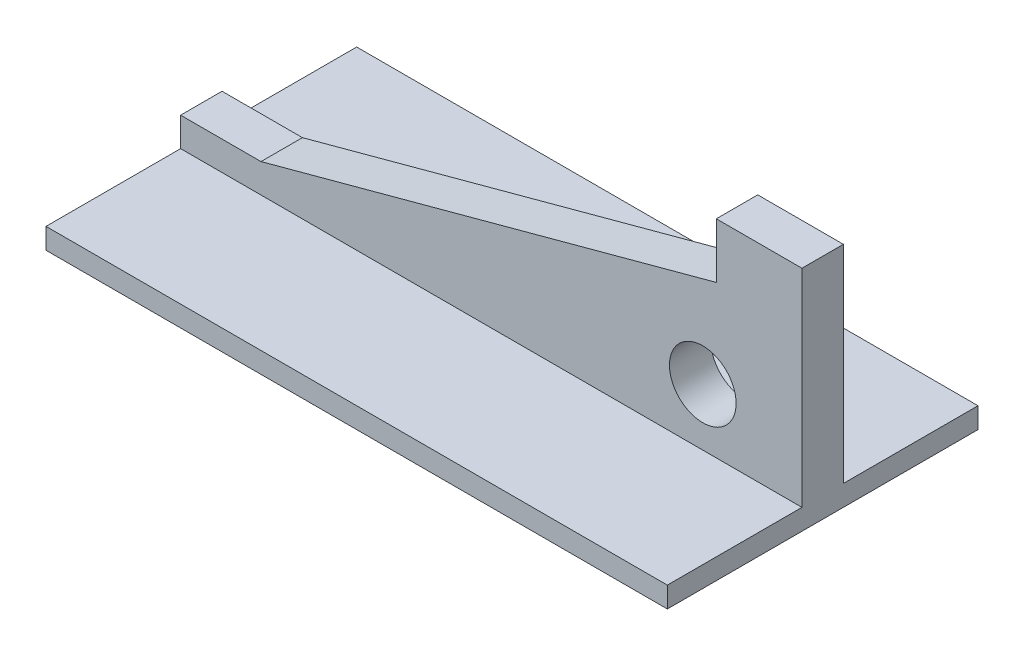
from build123d import *

# Parameters (mm, degrees)
SKETCH1_W      = 150
SKETCH1_H      = 75
EXTRUDE1_DEPTH = 5
SKETCH2_R      = 8.048853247
EXTRUDE2_DEPTH = 5


with BuildPart() as part:
    # Sketch1 → Extrude1 (new body)
    with BuildSketch(Plane(origin=(0, 0, 0), x_dir=(1, 0, 0), z_dir=(0, 1, 0))):
        Rectangle(SKETCH1_W, SKETCH1_H)
    extrude(amount=EXTRUDE1_DEPTH)

    # Sketch2 → Extrude2 (add, symmetric)
    with BuildSketch(Plane.XY):
        Polygon((54.32847428, 55), (54.32847428, 41.694430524), (-55.59454896, 12), (-75, 12), (-75, 5), (75, 5), (75, 55), align=None)
        with Locations((51.05709357, 18.76739402)):
            Circle(SKETCH2_R, mode=Mode.SUBTRACT)
    extrude(amount=EXTRUDE2_DEPTH, both=True)


solid = part.part
